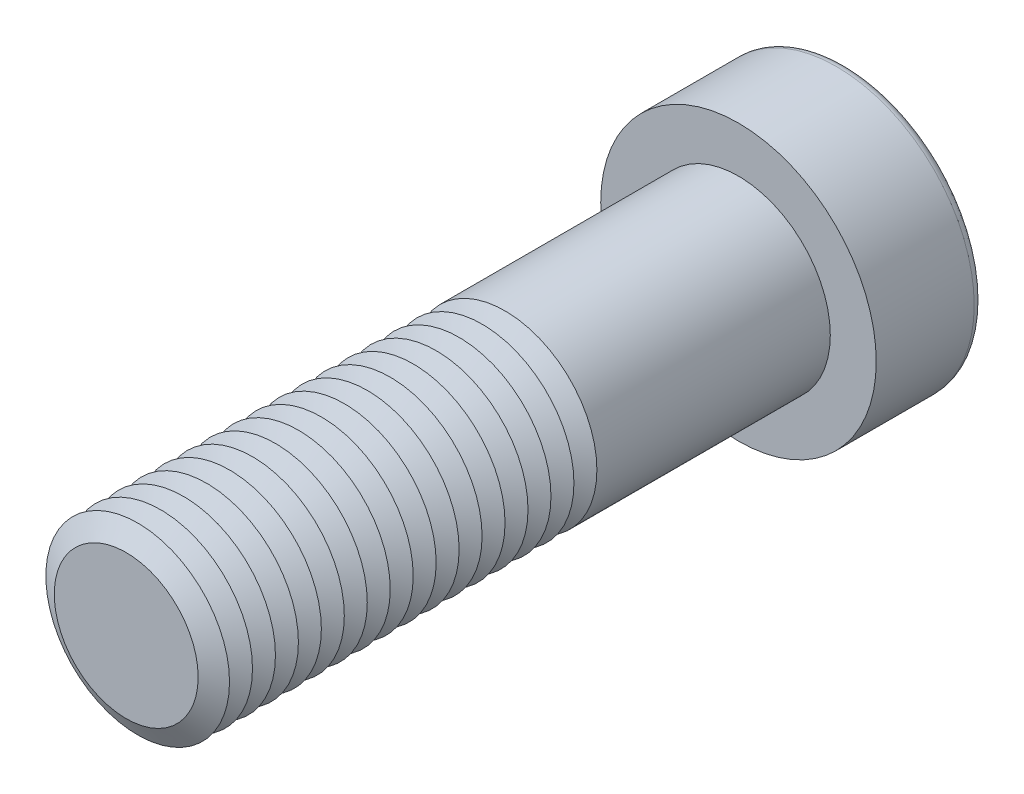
ISO-10303-21;
HEADER;
FILE_DESCRIPTION(('STEP AP214'),'2;1');
FILE_NAME('part.step','',(''),(''),'','','');
FILE_SCHEMA(('AUTOMOTIVE_DESIGN { 1 0 10303 214 1 1 1 1 }'));
ENDSEC;
DATA;
#1=APPLICATION_CONTEXT('core data for automotive mechanical design processes');
#2=APPLICATION_PROTOCOL_DEFINITION('international standard','automotive_design',2000,#1);
#3=PRODUCT_CONTEXT('',#1,'mechanical');
#4=PRODUCT('Part','Part','',(#3));
#5=PRODUCT_RELATED_PRODUCT_CATEGORY('part','',(#4));
#6=PRODUCT_DEFINITION_FORMATION('','',#4);
#7=PRODUCT_DEFINITION_CONTEXT('part definition',#1,'design');
#8=PRODUCT_DEFINITION('design','',#6,#7);
#9=PRODUCT_DEFINITION_SHAPE('','',#8);
#10=(LENGTH_UNIT() NAMED_UNIT(*) SI_UNIT(.MILLI.,.METRE.));
#11=(NAMED_UNIT(*) PLANE_ANGLE_UNIT() SI_UNIT($,.RADIAN.));
#12=(NAMED_UNIT(*) SI_UNIT($,.STERADIAN.) SOLID_ANGLE_UNIT());
#13=UNCERTAINTY_MEASURE_WITH_UNIT(LENGTH_MEASURE(1.E-05),#10,'distance_accuracy_value','');
#14=(GEOMETRIC_REPRESENTATION_CONTEXT(3) GLOBAL_UNCERTAINTY_ASSIGNED_CONTEXT((#13)) GLOBAL_UNIT_ASSIGNED_CONTEXT((#10,
#11,#12)) REPRESENTATION_CONTEXT('',''));
#15=CARTESIAN_POINT('',(0.,0.,0.));
#16=DIRECTION('',(0.,0.,1.));
#17=DIRECTION('',(1.,0.,0.));
#18=AXIS2_PLACEMENT_3D('',#15,#16,#17);
#19=CARTESIAN_POINT('',(0.,0.,69.5));
#20=DIRECTION('',(0.,0.,1.));
#21=DIRECTION('',(1.,0.,0.));
#22=AXIS2_PLACEMENT_3D('',#19,#20,#21);
#23=CONICAL_SURFACE('',#22,12.,1.0471975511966);
#24=CARTESIAN_POINT('',(0.,0.,68.));
#25=DIRECTION('',(0.,0.,1.));
#26=DIRECTION('',(1.,0.,0.));
#27=AXIS2_PLACEMENT_3D('',#24,#25,#26);
#28=CIRCLE('',#27,9.40192378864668);
#29=CARTESIAN_POINT('',(9.40192378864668,0.,68.));
#30=VERTEX_POINT('',#29);
#31=EDGE_CURVE('E312',#30,#30,#28,.T.);
#32=ORIENTED_EDGE('',*,*,#31,.T.);
#33=EDGE_LOOP('',(#32));
#34=FACE_BOUND('',#33,.T.);
#35=CARTESIAN_POINT('',(0.,0.,69.5));
#36=DIRECTION('',(0.,0.,1.));
#37=DIRECTION('',(1.,0.,0.));
#38=AXIS2_PLACEMENT_3D('',#35,#36,#37);
#39=CIRCLE('',#38,12.);
#40=CARTESIAN_POINT('',(12.,0.,69.5));
#41=VERTEX_POINT('',#40);
#42=EDGE_CURVE('E315',#41,#41,#39,.T.);
#43=ORIENTED_EDGE('',*,*,#42,.F.);
#44=EDGE_LOOP('',(#43));
#45=FACE_BOUND('',#44,.T.);
#46=ADVANCED_FACE('F39',(#34,#45),#23,.T.);
#47=CARTESIAN_POINT('',(0.,0.,68.));
#48=DIRECTION('',(0.,0.,-1.));
#49=DIRECTION('',(-1.,0.,0.));
#50=AXIS2_PLACEMENT_3D('',#47,#48,#49);
#51=CONICAL_SURFACE('',#50,9.40192378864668,1.0471975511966);
#52=CARTESIAN_POINT('',(0.,0.,66.5));
#53=DIRECTION('',(0.,0.,1.));
#54=DIRECTION('',(1.,0.,0.));
#55=AXIS2_PLACEMENT_3D('',#52,#53,#54);
#56=CIRCLE('',#55,12.);
#57=CARTESIAN_POINT('',(12.,0.,66.5));
#58=VERTEX_POINT('',#57);
#59=EDGE_CURVE('E323',#58,#58,#56,.T.);
#60=ORIENTED_EDGE('',*,*,#59,.T.);
#61=EDGE_LOOP('',(#60));
#62=FACE_BOUND('',#61,.T.);
#63=ORIENTED_EDGE('',*,*,#31,.F.);
#64=EDGE_LOOP('',(#63));
#65=FACE_BOUND('',#64,.T.);
#66=ADVANCED_FACE('F244',(#62,#65),#51,.T.);
#67=CARTESIAN_POINT('',(0.,0.,80.));
#68=DIRECTION('',(0.,0.,1.));
#69=DIRECTION('',(1.,0.,0.));
#70=AXIS2_PLACEMENT_3D('',#67,#68,#69);
#71=PLANE('',#70);
#72=CARTESIAN_POINT('',(0.,0.,80.));
#73=DIRECTION('',(0.,0.,1.));
#74=DIRECTION('',(1.,0.,0.));
#75=AXIS2_PLACEMENT_3D('',#72,#73,#74);
#76=CIRCLE('',#75,9.40192378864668);
#77=CARTESIAN_POINT('',(9.40192378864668,0.,80.));
#78=VERTEX_POINT('',#77);
#79=EDGE_CURVE('E174',#78,#78,#76,.T.);
#80=ORIENTED_EDGE('',*,*,#79,.T.);
#81=EDGE_LOOP('',(#80));
#82=FACE_BOUND('',#81,.T.);
#83=ADVANCED_FACE('F250',(#82),#71,.T.);
#84=CARTESIAN_POINT('',(0.,0.,80.));
#85=DIRECTION('',(0.,0.,-1.));
#86=DIRECTION('',(-1.,0.,0.));
#87=AXIS2_PLACEMENT_3D('',#84,#85,#86);
#88=CONICAL_SURFACE('',#87,9.40192378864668,1.0471975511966);
#89=CARTESIAN_POINT('',(0.,0.,78.5));
#90=DIRECTION('',(0.,0.,1.));
#91=DIRECTION('',(1.,0.,0.));
#92=AXIS2_PLACEMENT_3D('',#89,#90,#91);
#93=CIRCLE('',#92,12.);
#94=CARTESIAN_POINT('',(12.,0.,78.5));
#95=VERTEX_POINT('',#94);
#96=EDGE_CURVE('E290',#95,#95,#93,.T.);
#97=ORIENTED_EDGE('',*,*,#96,.T.);
#98=EDGE_LOOP('',(#97));
#99=FACE_BOUND('',#98,.T.);
#100=ORIENTED_EDGE('',*,*,#79,.F.);
#101=EDGE_LOOP('',(#100));
#102=FACE_BOUND('',#101,.T.);
#103=ADVANCED_FACE('F198',(#99,#102),#88,.T.);
#104=CARTESIAN_POINT('',(0.,0.,78.5));
#105=DIRECTION('',(0.,0.,1.));
#106=DIRECTION('',(1.,0.,0.));
#107=AXIS2_PLACEMENT_3D('',#104,#105,#106);
#108=CONICAL_SURFACE('',#107,12.,1.0471975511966);
#109=CARTESIAN_POINT('',(0.,0.,77.));
#110=DIRECTION('',(0.,0.,1.));
#111=DIRECTION('',(1.,0.,0.));
#112=AXIS2_PLACEMENT_3D('',#109,#110,#111);
#113=CIRCLE('',#112,9.40192378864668);
#114=CARTESIAN_POINT('',(9.40192378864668,0.,77.));
#115=VERTEX_POINT('',#114);
#116=EDGE_CURVE('E287',#115,#115,#113,.T.);
#117=ORIENTED_EDGE('',*,*,#116,.T.);
#118=EDGE_LOOP('',(#117));
#119=FACE_BOUND('',#118,.T.);
#120=ORIENTED_EDGE('',*,*,#96,.F.);
#121=EDGE_LOOP('',(#120));
#122=FACE_BOUND('',#121,.T.);
#123=ADVANCED_FACE('F276',(#119,#122),#108,.T.);
#124=CARTESIAN_POINT('',(0.,0.,77.));
#125=DIRECTION('',(0.,0.,-1.));
#126=DIRECTION('',(-1.,0.,0.));
#127=AXIS2_PLACEMENT_3D('',#124,#125,#126);
#128=CONICAL_SURFACE('',#127,9.40192378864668,1.0471975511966);
#129=CARTESIAN_POINT('',(0.,0.,75.5));
#130=DIRECTION('',(0.,0.,1.));
#131=DIRECTION('',(1.,0.,0.));
#132=AXIS2_PLACEMENT_3D('',#129,#130,#131);
#133=CIRCLE('',#132,12.);
#134=CARTESIAN_POINT('',(12.,0.,75.5));
#135=VERTEX_POINT('',#134);
#136=EDGE_CURVE('E298',#135,#135,#133,.T.);
#137=ORIENTED_EDGE('',*,*,#136,.T.);
#138=EDGE_LOOP('',(#137));
#139=FACE_BOUND('',#138,.T.);
#140=ORIENTED_EDGE('',*,*,#116,.F.);
#141=EDGE_LOOP('',(#140));
#142=FACE_BOUND('',#141,.T.);
#143=ADVANCED_FACE('F273',(#139,#142),#128,.T.);
#144=CARTESIAN_POINT('',(0.,0.,75.5));
#145=DIRECTION('',(0.,0.,1.));
#146=DIRECTION('',(1.,0.,0.));
#147=AXIS2_PLACEMENT_3D('',#144,#145,#146);
#148=CONICAL_SURFACE('',#147,12.,1.0471975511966);
#149=CARTESIAN_POINT('',(0.,0.,74.));
#150=DIRECTION('',(0.,0.,1.));
#151=DIRECTION('',(1.,0.,0.));
#152=AXIS2_PLACEMENT_3D('',#149,#150,#151);
#153=CIRCLE('',#152,9.40192378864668);
#154=CARTESIAN_POINT('',(9.40192378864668,0.,74.));
#155=VERTEX_POINT('',#154);
#156=EDGE_CURVE('E292',#155,#155,#153,.T.);
#157=ORIENTED_EDGE('',*,*,#156,.T.);
#158=EDGE_LOOP('',(#157));
#159=FACE_BOUND('',#158,.T.);
#160=ORIENTED_EDGE('',*,*,#136,.F.);
#161=EDGE_LOOP('',(#160));
#162=FACE_BOUND('',#161,.T.);
#163=ADVANCED_FACE('F269',(#159,#162),#148,.T.);
#164=CARTESIAN_POINT('',(0.,0.,74.));
#165=DIRECTION('',(0.,0.,-1.));
#166=DIRECTION('',(-1.,0.,0.));
#167=AXIS2_PLACEMENT_3D('',#164,#165,#166);
#168=CONICAL_SURFACE('',#167,9.40192378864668,1.0471975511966);
#169=CARTESIAN_POINT('',(0.,0.,72.5));
#170=DIRECTION('',(0.,0.,1.));
#171=DIRECTION('',(1.,0.,0.));
#172=AXIS2_PLACEMENT_3D('',#169,#170,#171);
#173=CIRCLE('',#172,12.);
#174=CARTESIAN_POINT('',(12.,0.,72.5));
#175=VERTEX_POINT('',#174);
#176=EDGE_CURVE('E308',#175,#175,#173,.T.);
#177=ORIENTED_EDGE('',*,*,#176,.T.);
#178=EDGE_LOOP('',(#177));
#179=FACE_BOUND('',#178,.T.);
#180=ORIENTED_EDGE('',*,*,#156,.F.);
#181=EDGE_LOOP('',(#180));
#182=FACE_BOUND('',#181,.T.);
#183=ADVANCED_FACE('F265',(#179,#182),#168,.T.);
#184=CARTESIAN_POINT('',(0.,0.,72.5));
#185=DIRECTION('',(0.,0.,1.));
#186=DIRECTION('',(1.,0.,0.));
#187=AXIS2_PLACEMENT_3D('',#184,#185,#186);
#188=CONICAL_SURFACE('',#187,12.,1.0471975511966);
#189=CARTESIAN_POINT('',(0.,0.,71.));
#190=DIRECTION('',(0.,0.,1.));
#191=DIRECTION('',(1.,0.,0.));
#192=AXIS2_PLACEMENT_3D('',#189,#190,#191);
#193=CIRCLE('',#192,9.40192378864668);
#194=CARTESIAN_POINT('',(9.40192378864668,0.,71.));
#195=VERTEX_POINT('',#194);
#196=EDGE_CURVE('E304',#195,#195,#193,.T.);
#197=ORIENTED_EDGE('',*,*,#196,.T.);
#198=EDGE_LOOP('',(#197));
#199=FACE_BOUND('',#198,.T.);
#200=ORIENTED_EDGE('',*,*,#176,.F.);
#201=EDGE_LOOP('',(#200));
#202=FACE_BOUND('',#201,.T.);
#203=ADVANCED_FACE('F261',(#199,#202),#188,.T.);
#204=CARTESIAN_POINT('',(0.,0.,71.));
#205=DIRECTION('',(0.,0.,-1.));
#206=DIRECTION('',(-1.,0.,0.));
#207=AXIS2_PLACEMENT_3D('',#204,#205,#206);
#208=CONICAL_SURFACE('',#207,9.40192378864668,1.0471975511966);
#209=ORIENTED_EDGE('',*,*,#42,.T.);
#210=EDGE_LOOP('',(#209));
#211=FACE_BOUND('',#210,.T.);
#212=ORIENTED_EDGE('',*,*,#196,.F.);
#213=EDGE_LOOP('',(#212));
#214=FACE_BOUND('',#213,.T.);
#215=ADVANCED_FACE('F257',(#211,#214),#208,.T.);
#216=CARTESIAN_POINT('',(0.,0.,66.5));
#217=DIRECTION('',(0.,0.,1.));
#218=DIRECTION('',(1.,0.,0.));
#219=AXIS2_PLACEMENT_3D('',#216,#217,#218);
#220=CONICAL_SURFACE('',#219,12.,1.0471975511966);
#221=CARTESIAN_POINT('',(0.,0.,65.));
#222=DIRECTION('',(0.,0.,1.));
#223=DIRECTION('',(1.,0.,0.));
#224=AXIS2_PLACEMENT_3D('',#221,#222,#223);
#225=CIRCLE('',#224,9.40192378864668);
#226=CARTESIAN_POINT('',(9.40192378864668,0.,65.));
#227=VERTEX_POINT('',#226);
#228=EDGE_CURVE('E319',#227,#227,#225,.T.);
#229=ORIENTED_EDGE('',*,*,#228,.T.);
#230=EDGE_LOOP('',(#229));
#231=FACE_BOUND('',#230,.T.);
#232=ORIENTED_EDGE('',*,*,#59,.F.);
#233=EDGE_LOOP('',(#232));
#234=FACE_BOUND('',#233,.T.);
#235=ADVANCED_FACE('F260',(#231,#234),#220,.T.);
#236=CARTESIAN_POINT('',(0.,0.,65.));
#237=DIRECTION('',(0.,0.,-1.));
#238=DIRECTION('',(-1.,0.,0.));
#239=AXIS2_PLACEMENT_3D('',#236,#237,#238);
#240=CONICAL_SURFACE('',#239,9.40192378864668,1.0471975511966);
#241=CARTESIAN_POINT('',(0.,0.,63.5));
#242=DIRECTION('',(0.,0.,1.));
#243=DIRECTION('',(1.,0.,0.));
#244=AXIS2_PLACEMENT_3D('',#241,#242,#243);
#245=CIRCLE('',#244,12.);
#246=CARTESIAN_POINT('',(12.,0.,63.5));
#247=VERTEX_POINT('',#246);
#248=EDGE_CURVE('E330',#247,#247,#245,.T.);
#249=ORIENTED_EDGE('',*,*,#248,.T.);
#250=EDGE_LOOP('',(#249));
#251=FACE_BOUND('',#250,.T.);
#252=ORIENTED_EDGE('',*,*,#228,.F.);
#253=EDGE_LOOP('',(#252));
#254=FACE_BOUND('',#253,.T.);
#255=ADVANCED_FACE('F509',(#251,#254),#240,.T.);
#256=CARTESIAN_POINT('',(0.,0.,63.5));
#257=DIRECTION('',(0.,0.,1.));
#258=DIRECTION('',(1.,0.,0.));
#259=AXIS2_PLACEMENT_3D('',#256,#257,#258);
#260=CONICAL_SURFACE('',#259,12.,1.0471975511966);
#261=CARTESIAN_POINT('',(0.,0.,62.));
#262=DIRECTION('',(0.,0.,1.));
#263=DIRECTION('',(1.,0.,0.));
#264=AXIS2_PLACEMENT_3D('',#261,#262,#263);
#265=CIRCLE('',#264,9.40192378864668);
#266=CARTESIAN_POINT('',(9.40192378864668,0.,62.));
#267=VERTEX_POINT('',#266);
#268=EDGE_CURVE('E327',#267,#267,#265,.T.);
#269=ORIENTED_EDGE('',*,*,#268,.T.);
#270=EDGE_LOOP('',(#269));
#271=FACE_BOUND('',#270,.T.);
#272=ORIENTED_EDGE('',*,*,#248,.F.);
#273=EDGE_LOOP('',(#272));
#274=FACE_BOUND('',#273,.T.);
#275=ADVANCED_FACE('F505',(#271,#274),#260,.T.);
#276=CARTESIAN_POINT('',(0.,0.,62.));
#277=DIRECTION('',(0.,0.,-1.));
#278=DIRECTION('',(-1.,0.,0.));
#279=AXIS2_PLACEMENT_3D('',#276,#277,#278);
#280=CONICAL_SURFACE('',#279,9.40192378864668,1.0471975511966);
#281=CARTESIAN_POINT('',(0.,0.,60.5));
#282=DIRECTION('',(0.,0.,1.));
#283=DIRECTION('',(1.,0.,0.));
#284=AXIS2_PLACEMENT_3D('',#281,#282,#283);
#285=CIRCLE('',#284,12.);
#286=CARTESIAN_POINT('',(12.,0.,60.5));
#287=VERTEX_POINT('',#286);
#288=EDGE_CURVE('E338',#287,#287,#285,.T.);
#289=ORIENTED_EDGE('',*,*,#288,.T.);
#290=EDGE_LOOP('',(#289));
#291=FACE_BOUND('',#290,.T.);
#292=ORIENTED_EDGE('',*,*,#268,.F.);
#293=EDGE_LOOP('',(#292));
#294=FACE_BOUND('',#293,.T.);
#295=ADVANCED_FACE('F501',(#291,#294),#280,.T.);
#296=CARTESIAN_POINT('',(0.,0.,60.5));
#297=DIRECTION('',(0.,0.,1.));
#298=DIRECTION('',(1.,0.,0.));
#299=AXIS2_PLACEMENT_3D('',#296,#297,#298);
#300=CONICAL_SURFACE('',#299,12.,1.0471975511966);
#301=CARTESIAN_POINT('',(0.,0.,59.));
#302=DIRECTION('',(0.,0.,1.));
#303=DIRECTION('',(1.,0.,0.));
#304=AXIS2_PLACEMENT_3D('',#301,#302,#303);
#305=CIRCLE('',#304,9.40192378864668);
#306=CARTESIAN_POINT('',(9.40192378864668,0.,59.));
#307=VERTEX_POINT('',#306);
#308=EDGE_CURVE('E334',#307,#307,#305,.T.);
#309=ORIENTED_EDGE('',*,*,#308,.T.);
#310=EDGE_LOOP('',(#309));
#311=FACE_BOUND('',#310,.T.);
#312=ORIENTED_EDGE('',*,*,#288,.F.);
#313=EDGE_LOOP('',(#312));
#314=FACE_BOUND('',#313,.T.);
#315=ADVANCED_FACE('F497',(#311,#314),#300,.T.);
#316=CARTESIAN_POINT('',(0.,0.,59.));
#317=DIRECTION('',(0.,0.,-1.));
#318=DIRECTION('',(-1.,0.,0.));
#319=AXIS2_PLACEMENT_3D('',#316,#317,#318);
#320=CONICAL_SURFACE('',#319,9.40192378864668,1.0471975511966);
#321=CARTESIAN_POINT('',(0.,0.,57.5));
#322=DIRECTION('',(0.,0.,1.));
#323=DIRECTION('',(1.,0.,0.));
#324=AXIS2_PLACEMENT_3D('',#321,#322,#323);
#325=CIRCLE('',#324,12.);
#326=CARTESIAN_POINT('',(12.,0.,57.5));
#327=VERTEX_POINT('',#326);
#328=EDGE_CURVE('E346',#327,#327,#325,.T.);
#329=ORIENTED_EDGE('',*,*,#328,.T.);
#330=EDGE_LOOP('',(#329));
#331=FACE_BOUND('',#330,.T.);
#332=ORIENTED_EDGE('',*,*,#308,.F.);
#333=EDGE_LOOP('',(#332));
#334=FACE_BOUND('',#333,.T.);
#335=ADVANCED_FACE('F493',(#331,#334),#320,.T.);
#336=CARTESIAN_POINT('',(0.,0.,57.5));
#337=DIRECTION('',(0.,0.,1.));
#338=DIRECTION('',(1.,0.,0.));
#339=AXIS2_PLACEMENT_3D('',#336,#337,#338);
#340=CONICAL_SURFACE('',#339,12.,1.0471975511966);
#341=CARTESIAN_POINT('',(0.,0.,56.));
#342=DIRECTION('',(0.,0.,1.));
#343=DIRECTION('',(1.,0.,0.));
#344=AXIS2_PLACEMENT_3D('',#341,#342,#343);
#345=CIRCLE('',#344,9.40192378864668);
#346=CARTESIAN_POINT('',(9.40192378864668,0.,56.));
#347=VERTEX_POINT('',#346);
#348=EDGE_CURVE('E342',#347,#347,#345,.T.);
#349=ORIENTED_EDGE('',*,*,#348,.T.);
#350=EDGE_LOOP('',(#349));
#351=FACE_BOUND('',#350,.T.);
#352=ORIENTED_EDGE('',*,*,#328,.F.);
#353=EDGE_LOOP('',(#352));
#354=FACE_BOUND('',#353,.T.);
#355=ADVANCED_FACE('F489',(#351,#354),#340,.T.);
#356=CARTESIAN_POINT('',(0.,0.,56.));
#357=DIRECTION('',(0.,0.,-1.));
#358=DIRECTION('',(-1.,0.,0.));
#359=AXIS2_PLACEMENT_3D('',#356,#357,#358);
#360=CONICAL_SURFACE('',#359,9.40192378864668,1.0471975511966);
#361=CARTESIAN_POINT('',(0.,0.,54.5));
#362=DIRECTION('',(0.,0.,1.));
#363=DIRECTION('',(1.,0.,0.));
#364=AXIS2_PLACEMENT_3D('',#361,#362,#363);
#365=CIRCLE('',#364,12.);
#366=CARTESIAN_POINT('',(12.,0.,54.5));
#367=VERTEX_POINT('',#366);
#368=EDGE_CURVE('E354',#367,#367,#365,.T.);
#369=ORIENTED_EDGE('',*,*,#368,.T.);
#370=EDGE_LOOP('',(#369));
#371=FACE_BOUND('',#370,.T.);
#372=ORIENTED_EDGE('',*,*,#348,.F.);
#373=EDGE_LOOP('',(#372));
#374=FACE_BOUND('',#373,.T.);
#375=ADVANCED_FACE('F485',(#371,#374),#360,.T.);
#376=CARTESIAN_POINT('',(0.,0.,54.5));
#377=DIRECTION('',(0.,0.,1.));
#378=DIRECTION('',(1.,0.,0.));
#379=AXIS2_PLACEMENT_3D('',#376,#377,#378);
#380=CONICAL_SURFACE('',#379,12.,1.0471975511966);
#381=CARTESIAN_POINT('',(0.,0.,53.));
#382=DIRECTION('',(0.,0.,1.));
#383=DIRECTION('',(1.,0.,0.));
#384=AXIS2_PLACEMENT_3D('',#381,#382,#383);
#385=CIRCLE('',#384,9.40192378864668);
#386=CARTESIAN_POINT('',(9.40192378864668,0.,53.));
#387=VERTEX_POINT('',#386);
#388=EDGE_CURVE('E350',#387,#387,#385,.T.);
#389=ORIENTED_EDGE('',*,*,#388,.T.);
#390=EDGE_LOOP('',(#389));
#391=FACE_BOUND('',#390,.T.);
#392=ORIENTED_EDGE('',*,*,#368,.F.);
#393=EDGE_LOOP('',(#392));
#394=FACE_BOUND('',#393,.T.);
#395=ADVANCED_FACE('F481',(#391,#394),#380,.T.);
#396=CARTESIAN_POINT('',(0.,0.,53.));
#397=DIRECTION('',(0.,0.,-1.));
#398=DIRECTION('',(-1.,0.,0.));
#399=AXIS2_PLACEMENT_3D('',#396,#397,#398);
#400=CONICAL_SURFACE('',#399,9.40192378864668,1.0471975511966);
#401=CARTESIAN_POINT('',(0.,0.,51.5));
#402=DIRECTION('',(0.,0.,1.));
#403=DIRECTION('',(1.,0.,0.));
#404=AXIS2_PLACEMENT_3D('',#401,#402,#403);
#405=CIRCLE('',#404,12.);
#406=CARTESIAN_POINT('',(12.,0.,51.5));
#407=VERTEX_POINT('',#406);
#408=EDGE_CURVE('E362',#407,#407,#405,.T.);
#409=ORIENTED_EDGE('',*,*,#408,.T.);
#410=EDGE_LOOP('',(#409));
#411=FACE_BOUND('',#410,.T.);
#412=ORIENTED_EDGE('',*,*,#388,.F.);
#413=EDGE_LOOP('',(#412));
#414=FACE_BOUND('',#413,.T.);
#415=ADVANCED_FACE('F477',(#411,#414),#400,.T.);
#416=CARTESIAN_POINT('',(0.,0.,51.5));
#417=DIRECTION('',(0.,0.,1.));
#418=DIRECTION('',(1.,0.,0.));
#419=AXIS2_PLACEMENT_3D('',#416,#417,#418);
#420=CONICAL_SURFACE('',#419,12.,1.0471975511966);
#421=CARTESIAN_POINT('',(0.,0.,50.));
#422=DIRECTION('',(0.,0.,1.));
#423=DIRECTION('',(1.,0.,0.));
#424=AXIS2_PLACEMENT_3D('',#421,#422,#423);
#425=CIRCLE('',#424,9.40192378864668);
#426=CARTESIAN_POINT('',(9.40192378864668,0.,50.));
#427=VERTEX_POINT('',#426);
#428=EDGE_CURVE('E358',#427,#427,#425,.T.);
#429=ORIENTED_EDGE('',*,*,#428,.T.);
#430=EDGE_LOOP('',(#429));
#431=FACE_BOUND('',#430,.T.);
#432=ORIENTED_EDGE('',*,*,#408,.F.);
#433=EDGE_LOOP('',(#432));
#434=FACE_BOUND('',#433,.T.);
#435=ADVANCED_FACE('F473',(#431,#434),#420,.T.);
#436=CARTESIAN_POINT('',(0.,0.,50.));
#437=DIRECTION('',(0.,0.,-1.));
#438=DIRECTION('',(-1.,0.,0.));
#439=AXIS2_PLACEMENT_3D('',#436,#437,#438);
#440=CONICAL_SURFACE('',#439,9.40192378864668,1.0471975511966);
#441=CARTESIAN_POINT('',(0.,0.,48.5));
#442=DIRECTION('',(0.,0.,1.));
#443=DIRECTION('',(1.,0.,0.));
#444=AXIS2_PLACEMENT_3D('',#441,#442,#443);
#445=CIRCLE('',#444,12.);
#446=CARTESIAN_POINT('',(12.,0.,48.5));
#447=VERTEX_POINT('',#446);
#448=EDGE_CURVE('E370',#447,#447,#445,.T.);
#449=ORIENTED_EDGE('',*,*,#448,.T.);
#450=EDGE_LOOP('',(#449));
#451=FACE_BOUND('',#450,.T.);
#452=ORIENTED_EDGE('',*,*,#428,.F.);
#453=EDGE_LOOP('',(#452));
#454=FACE_BOUND('',#453,.T.);
#455=ADVANCED_FACE('F469',(#451,#454),#440,.T.);
#456=CARTESIAN_POINT('',(0.,0.,48.5));
#457=DIRECTION('',(0.,0.,1.));
#458=DIRECTION('',(1.,0.,0.));
#459=AXIS2_PLACEMENT_3D('',#456,#457,#458);
#460=CONICAL_SURFACE('',#459,12.,1.0471975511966);
#461=CARTESIAN_POINT('',(0.,0.,47.));
#462=DIRECTION('',(0.,0.,1.));
#463=DIRECTION('',(1.,0.,0.));
#464=AXIS2_PLACEMENT_3D('',#461,#462,#463);
#465=CIRCLE('',#464,9.40192378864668);
#466=CARTESIAN_POINT('',(9.40192378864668,0.,47.));
#467=VERTEX_POINT('',#466);
#468=EDGE_CURVE('E366',#467,#467,#465,.T.);
#469=ORIENTED_EDGE('',*,*,#468,.T.);
#470=EDGE_LOOP('',(#469));
#471=FACE_BOUND('',#470,.T.);
#472=ORIENTED_EDGE('',*,*,#448,.F.);
#473=EDGE_LOOP('',(#472));
#474=FACE_BOUND('',#473,.T.);
#475=ADVANCED_FACE('F465',(#471,#474),#460,.T.);
#476=CARTESIAN_POINT('',(0.,0.,47.));
#477=DIRECTION('',(0.,0.,-1.));
#478=DIRECTION('',(-1.,0.,0.));
#479=AXIS2_PLACEMENT_3D('',#476,#477,#478);
#480=CONICAL_SURFACE('',#479,9.40192378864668,1.0471975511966);
#481=CARTESIAN_POINT('',(0.,0.,45.5));
#482=DIRECTION('',(0.,0.,1.));
#483=DIRECTION('',(1.,0.,0.));
#484=AXIS2_PLACEMENT_3D('',#481,#482,#483);
#485=CIRCLE('',#484,12.);
#486=CARTESIAN_POINT('',(12.,0.,45.5));
#487=VERTEX_POINT('',#486);
#488=EDGE_CURVE('E378',#487,#487,#485,.T.);
#489=ORIENTED_EDGE('',*,*,#488,.T.);
#490=EDGE_LOOP('',(#489));
#491=FACE_BOUND('',#490,.T.);
#492=ORIENTED_EDGE('',*,*,#468,.F.);
#493=EDGE_LOOP('',(#492));
#494=FACE_BOUND('',#493,.T.);
#495=ADVANCED_FACE('F461',(#491,#494),#480,.T.);
#496=CARTESIAN_POINT('',(0.,0.,45.5));
#497=DIRECTION('',(0.,0.,1.));
#498=DIRECTION('',(1.,0.,0.));
#499=AXIS2_PLACEMENT_3D('',#496,#497,#498);
#500=CONICAL_SURFACE('',#499,12.,1.0471975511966);
#501=CARTESIAN_POINT('',(0.,0.,44.));
#502=DIRECTION('',(0.,0.,1.));
#503=DIRECTION('',(1.,0.,0.));
#504=AXIS2_PLACEMENT_3D('',#501,#502,#503);
#505=CIRCLE('',#504,9.40192378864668);
#506=CARTESIAN_POINT('',(9.40192378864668,0.,44.));
#507=VERTEX_POINT('',#506);
#508=EDGE_CURVE('E374',#507,#507,#505,.T.);
#509=ORIENTED_EDGE('',*,*,#508,.T.);
#510=EDGE_LOOP('',(#509));
#511=FACE_BOUND('',#510,.T.);
#512=ORIENTED_EDGE('',*,*,#488,.F.);
#513=EDGE_LOOP('',(#512));
#514=FACE_BOUND('',#513,.T.);
#515=ADVANCED_FACE('F457',(#511,#514),#500,.T.);
#516=CARTESIAN_POINT('',(0.,0.,44.));
#517=DIRECTION('',(0.,0.,-1.));
#518=DIRECTION('',(-1.,0.,0.));
#519=AXIS2_PLACEMENT_3D('',#516,#517,#518);
#520=CONICAL_SURFACE('',#519,9.40192378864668,1.0471975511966);
#521=CARTESIAN_POINT('',(0.,0.,42.5));
#522=DIRECTION('',(0.,0.,1.));
#523=DIRECTION('',(1.,0.,0.));
#524=AXIS2_PLACEMENT_3D('',#521,#522,#523);
#525=CIRCLE('',#524,12.);
#526=CARTESIAN_POINT('',(12.,0.,42.5));
#527=VERTEX_POINT('',#526);
#528=EDGE_CURVE('E385',#527,#527,#525,.T.);
#529=ORIENTED_EDGE('',*,*,#528,.T.);
#530=EDGE_LOOP('',(#529));
#531=FACE_BOUND('',#530,.T.);
#532=ORIENTED_EDGE('',*,*,#508,.F.);
#533=EDGE_LOOP('',(#532));
#534=FACE_BOUND('',#533,.T.);
#535=ADVANCED_FACE('F453',(#531,#534),#520,.T.);
#536=CARTESIAN_POINT('',(0.,0.,42.5));
#537=DIRECTION('',(0.,0.,1.));
#538=DIRECTION('',(1.,0.,0.));
#539=AXIS2_PLACEMENT_3D('',#536,#537,#538);
#540=CONICAL_SURFACE('',#539,12.,1.0471975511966);
#541=CARTESIAN_POINT('',(0.,0.,41.));
#542=DIRECTION('',(0.,0.,1.));
#543=DIRECTION('',(1.,0.,0.));
#544=AXIS2_PLACEMENT_3D('',#541,#542,#543);
#545=CIRCLE('',#544,9.40192378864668);
#546=CARTESIAN_POINT('',(9.40192378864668,0.,41.));
#547=VERTEX_POINT('',#546);
#548=EDGE_CURVE('E382',#547,#547,#545,.T.);
#549=ORIENTED_EDGE('',*,*,#548,.T.);
#550=EDGE_LOOP('',(#549));
#551=FACE_BOUND('',#550,.T.);
#552=ORIENTED_EDGE('',*,*,#528,.F.);
#553=EDGE_LOOP('',(#552));
#554=FACE_BOUND('',#553,.T.);
#555=ADVANCED_FACE('F449',(#551,#554),#540,.T.);
#556=CARTESIAN_POINT('',(0.,0.,41.));
#557=DIRECTION('',(0.,0.,-1.));
#558=DIRECTION('',(-1.,0.,0.));
#559=AXIS2_PLACEMENT_3D('',#556,#557,#558);
#560=CONICAL_SURFACE('',#559,9.40192378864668,1.0471975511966);
#561=CARTESIAN_POINT('',(0.,0.,39.5));
#562=DIRECTION('',(0.,0.,1.));
#563=DIRECTION('',(1.,0.,0.));
#564=AXIS2_PLACEMENT_3D('',#561,#562,#563);
#565=CIRCLE('',#564,12.);
#566=CARTESIAN_POINT('',(12.,0.,39.5));
#567=VERTEX_POINT('',#566);
#568=EDGE_CURVE('E393',#567,#567,#565,.T.);
#569=ORIENTED_EDGE('',*,*,#568,.T.);
#570=EDGE_LOOP('',(#569));
#571=FACE_BOUND('',#570,.T.);
#572=ORIENTED_EDGE('',*,*,#548,.F.);
#573=EDGE_LOOP('',(#572));
#574=FACE_BOUND('',#573,.T.);
#575=ADVANCED_FACE('F445',(#571,#574),#560,.T.);
#576=CARTESIAN_POINT('',(0.,0.,39.5));
#577=DIRECTION('',(0.,0.,1.));
#578=DIRECTION('',(1.,0.,0.));
#579=AXIS2_PLACEMENT_3D('',#576,#577,#578);
#580=CONICAL_SURFACE('',#579,12.,1.0471975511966);
#581=CARTESIAN_POINT('',(0.,0.,38.));
#582=DIRECTION('',(0.,0.,1.));
#583=DIRECTION('',(1.,0.,0.));
#584=AXIS2_PLACEMENT_3D('',#581,#582,#583);
#585=CIRCLE('',#584,9.40192378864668);
#586=CARTESIAN_POINT('',(9.40192378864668,0.,38.));
#587=VERTEX_POINT('',#586);
#588=EDGE_CURVE('E389',#587,#587,#585,.T.);
#589=ORIENTED_EDGE('',*,*,#588,.T.);
#590=EDGE_LOOP('',(#589));
#591=FACE_BOUND('',#590,.T.);
#592=ORIENTED_EDGE('',*,*,#568,.F.);
#593=EDGE_LOOP('',(#592));
#594=FACE_BOUND('',#593,.T.);
#595=ADVANCED_FACE('F441',(#591,#594),#580,.T.);
#596=CARTESIAN_POINT('',(0.,0.,38.));
#597=DIRECTION('',(0.,0.,-1.));
#598=DIRECTION('',(-1.,0.,0.));
#599=AXIS2_PLACEMENT_3D('',#596,#597,#598);
#600=CONICAL_SURFACE('',#599,9.40192378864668,1.0471975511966);
#601=CARTESIAN_POINT('',(0.,0.,36.5));
#602=DIRECTION('',(0.,0.,1.));
#603=DIRECTION('',(1.,0.,0.));
#604=AXIS2_PLACEMENT_3D('',#601,#602,#603);
#605=CIRCLE('',#604,12.);
#606=CARTESIAN_POINT('',(12.,0.,36.5));
#607=VERTEX_POINT('',#606);
#608=EDGE_CURVE('E401',#607,#607,#605,.T.);
#609=ORIENTED_EDGE('',*,*,#608,.T.);
#610=EDGE_LOOP('',(#609));
#611=FACE_BOUND('',#610,.T.);
#612=ORIENTED_EDGE('',*,*,#588,.F.);
#613=EDGE_LOOP('',(#612));
#614=FACE_BOUND('',#613,.T.);
#615=ADVANCED_FACE('F437',(#611,#614),#600,.T.);
#616=CARTESIAN_POINT('',(0.,0.,36.5));
#617=DIRECTION('',(0.,0.,1.));
#618=DIRECTION('',(1.,0.,0.));
#619=AXIS2_PLACEMENT_3D('',#616,#617,#618);
#620=CONICAL_SURFACE('',#619,12.,1.0471975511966);
#621=CARTESIAN_POINT('',(0.,0.,35.));
#622=DIRECTION('',(0.,0.,1.));
#623=DIRECTION('',(1.,0.,0.));
#624=AXIS2_PLACEMENT_3D('',#621,#622,#623);
#625=CIRCLE('',#624,9.40192378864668);
#626=CARTESIAN_POINT('',(9.40192378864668,0.,35.));
#627=VERTEX_POINT('',#626);
#628=EDGE_CURVE('E397',#627,#627,#625,.T.);
#629=ORIENTED_EDGE('',*,*,#628,.T.);
#630=EDGE_LOOP('',(#629));
#631=FACE_BOUND('',#630,.T.);
#632=ORIENTED_EDGE('',*,*,#608,.F.);
#633=EDGE_LOOP('',(#632));
#634=FACE_BOUND('',#633,.T.);
#635=ADVANCED_FACE('F432',(#631,#634),#620,.T.);
#636=CARTESIAN_POINT('',(0.,0.,35.));
#637=DIRECTION('',(0.,0.,-1.));
#638=DIRECTION('',(-1.,0.,0.));
#639=AXIS2_PLACEMENT_3D('',#636,#637,#638);
#640=CONICAL_SURFACE('',#639,9.40192378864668,1.0471975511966);
#641=CARTESIAN_POINT('',(0.,0.,33.5));
#642=DIRECTION('',(0.,0.,1.));
#643=DIRECTION('',(1.,0.,0.));
#644=AXIS2_PLACEMENT_3D('',#641,#642,#643);
#645=CIRCLE('',#644,12.);
#646=CARTESIAN_POINT('',(12.,0.,33.5));
#647=VERTEX_POINT('',#646);
#648=EDGE_CURVE('E413',#647,#647,#645,.T.);
#649=ORIENTED_EDGE('',*,*,#648,.T.);
#650=EDGE_LOOP('',(#649));
#651=FACE_BOUND('',#650,.T.);
#652=ORIENTED_EDGE('',*,*,#628,.F.);
#653=EDGE_LOOP('',(#652));
#654=FACE_BOUND('',#653,.T.);
#655=ADVANCED_FACE('F418',(#651,#654),#640,.T.);
#656=CARTESIAN_POINT('',(0.,0.,33.5));
#657=DIRECTION('',(0.,0.,1.));
#658=DIRECTION('',(1.,0.,0.));
#659=AXIS2_PLACEMENT_3D('',#656,#657,#658);
#660=CONICAL_SURFACE('',#659,12.,1.0471975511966);
#661=CARTESIAN_POINT('',(0.,0.,32.));
#662=DIRECTION('',(0.,0.,1.));
#663=DIRECTION('',(1.,0.,0.));
#664=AXIS2_PLACEMENT_3D('',#661,#662,#663);
#665=CIRCLE('',#664,9.40192378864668);
#666=CARTESIAN_POINT('',(9.40192378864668,0.,32.));
#667=VERTEX_POINT('',#666);
#668=EDGE_CURVE('E405',#667,#667,#665,.T.);
#669=ORIENTED_EDGE('',*,*,#668,.T.);
#670=EDGE_LOOP('',(#669));
#671=FACE_BOUND('',#670,.T.);
#672=ORIENTED_EDGE('',*,*,#648,.F.);
#673=EDGE_LOOP('',(#672));
#674=FACE_BOUND('',#673,.T.);
#675=ADVANCED_FACE('F421',(#671,#674),#660,.T.);
#676=CARTESIAN_POINT('',(0.,0.,32.));
#677=DIRECTION('',(0.,0.,-1.));
#678=DIRECTION('',(-1.,0.,0.));
#679=AXIS2_PLACEMENT_3D('',#676,#677,#678);
#680=CONICAL_SURFACE('',#679,9.40192378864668,1.0471975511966);
#681=CARTESIAN_POINT('',(0.,0.,30.5));
#682=DIRECTION('',(0.,0.,1.));
#683=DIRECTION('',(1.,0.,0.));
#684=AXIS2_PLACEMENT_3D('',#681,#682,#683);
#685=CIRCLE('',#684,12.);
#686=CARTESIAN_POINT('',(12.,0.,30.5));
#687=VERTEX_POINT('',#686);
#688=EDGE_CURVE('E409',#687,#687,#685,.T.);
#689=ORIENTED_EDGE('',*,*,#688,.T.);
#690=EDGE_LOOP('',(#689));
#691=FACE_BOUND('',#690,.T.);
#692=ORIENTED_EDGE('',*,*,#668,.F.);
#693=EDGE_LOOP('',(#692));
#694=FACE_BOUND('',#693,.T.);
#695=ADVANCED_FACE('F423',(#691,#694),#680,.T.);
#696=CARTESIAN_POINT('',(0.,0.,0.25));
#697=DIRECTION('',(0.,0.,-1.));
#698=DIRECTION('',(-1.,0.,0.));
#699=AXIS2_PLACEMENT_3D('',#696,#697,#698);
#700=CONICAL_SURFACE('',#699,9.5,1.0471975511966);
#701=CARTESIAN_POINT('',(0.,0.,5.73482755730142));
#702=VERTEX_POINT('',#701);
#703=VERTEX_LOOP('',#702);
#704=FACE_BOUND('',#703,.T.);
#705=CARTESIAN_POINT('',(0.,0.,0.25));
#706=DIRECTION('',(0.,0.,-1.));
#707=DIRECTION('',(-1.,0.,0.));
#708=AXIS2_PLACEMENT_3D('',#705,#706,#707);
#709=CIRCLE('',#708,9.5);
#710=CARTESIAN_POINT('',(-8.22724133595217,4.75,0.25));
#711=VERTEX_POINT('',#710);
#712=CARTESIAN_POINT('',(0.,9.5,0.25));
#713=VERTEX_POINT('',#712);
#714=EDGE_CURVE('E149',#711,#713,#709,.T.);
#715=ORIENTED_EDGE('',*,*,#714,.T.);
#716=CARTESIAN_POINT('',(0.,0.,0.25));
#717=DIRECTION('',(0.,0.,-1.));
#718=DIRECTION('',(-1.,0.,0.));
#719=AXIS2_PLACEMENT_3D('',#716,#717,#718);
#720=CIRCLE('',#719,9.5);
#721=CARTESIAN_POINT('',(8.22724133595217,4.75,0.25));
#722=VERTEX_POINT('',#721);
#723=EDGE_CURVE('E54',#713,#722,#720,.T.);
#724=ORIENTED_EDGE('',*,*,#723,.T.);
#725=CARTESIAN_POINT('',(8.22724133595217,-4.75,0.25));
#726=VERTEX_POINT('',#725);
#727=EDGE_CURVE('E1024',#722,#726,#720,.T.);
#728=ORIENTED_EDGE('',*,*,#727,.T.);
#729=CARTESIAN_POINT('',(0.,-9.5,0.25));
#730=VERTEX_POINT('',#729);
#731=EDGE_CURVE('E1023',#726,#730,#720,.T.);
#732=ORIENTED_EDGE('',*,*,#731,.T.);
#733=CARTESIAN_POINT('',(-8.22724133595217,-4.75,0.25));
#734=VERTEX_POINT('',#733);
#735=EDGE_CURVE('E1018',#730,#734,#720,.T.);
#736=ORIENTED_EDGE('',*,*,#735,.T.);
#737=EDGE_CURVE('E1016',#734,#711,#720,.T.);
#738=ORIENTED_EDGE('',*,*,#737,.T.);
#739=EDGE_LOOP('',(#715,#724,#728,#732,#736,#738));
#740=FACE_BOUND('',#739,.T.);
#741=ADVANCED_FACE('F200',(#704,#740),#700,.F.);
#742=CARTESIAN_POINT('',(0.,0.,0.25));
#743=DIRECTION('',(0.,0.,-1.));
#744=DIRECTION('',(-1.,0.,0.));
#745=AXIS2_PLACEMENT_3D('',#742,#743,#744);
#746=PLANE('',#745);
#747=ORIENTED_EDGE('',*,*,#723,.F.);
#748=DIRECTION('',(1.,0.,0.));
#749=VECTOR('',#748,1.);
#750=CARTESIAN_POINT('',(-5.48482755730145,9.5,0.25));
#751=LINE('',#750,#749);
#752=CARTESIAN_POINT('',(5.48482755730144,9.5,0.25));
#753=VERTEX_POINT('',#752);
#754=EDGE_CURVE('E1066',#713,#753,#751,.T.);
#755=ORIENTED_EDGE('',*,*,#754,.T.);
#756=DIRECTION('',(0.5,-0.866025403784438,0.));
#757=VECTOR('',#756,1.);
#758=CARTESIAN_POINT('',(5.48482755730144,9.5,0.25));
#759=LINE('',#758,#757);
#760=EDGE_CURVE('E155',#753,#722,#759,.T.);
#761=ORIENTED_EDGE('',*,*,#760,.T.);
#762=EDGE_LOOP('',(#747,#755,#761));
#763=FACE_BOUND('',#762,.T.);
#764=ADVANCED_FACE('F604',(#763),#746,.T.);
#765=ORIENTED_EDGE('',*,*,#727,.F.);
#766=CARTESIAN_POINT('',(10.9696551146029,0.,0.25));
#767=VERTEX_POINT('',#766);
#768=EDGE_CURVE('E1065',#722,#767,#759,.T.);
#769=ORIENTED_EDGE('',*,*,#768,.T.);
#770=DIRECTION('',(-0.5,-0.866025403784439,0.));
#771=VECTOR('',#770,1.);
#772=CARTESIAN_POINT('',(10.9696551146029,0.,0.25));
#773=LINE('',#772,#771);
#774=EDGE_CURVE('E1038',#767,#726,#773,.T.);
#775=ORIENTED_EDGE('',*,*,#774,.T.);
#776=EDGE_LOOP('',(#765,#769,#775));
#777=FACE_BOUND('',#776,.T.);
#778=ADVANCED_FACE('F614',(#777),#746,.T.);
#779=ORIENTED_EDGE('',*,*,#731,.F.);
#780=CARTESIAN_POINT('',(5.48482755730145,-9.5,0.25));
#781=VERTEX_POINT('',#780);
#782=EDGE_CURVE('E1040',#726,#781,#773,.T.);
#783=ORIENTED_EDGE('',*,*,#782,.T.);
#784=DIRECTION('',(-1.,0.,0.));
#785=VECTOR('',#784,1.);
#786=CARTESIAN_POINT('',(5.48482755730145,-9.5,0.25));
#787=LINE('',#786,#785);
#788=EDGE_CURVE('E991',#781,#730,#787,.T.);
#789=ORIENTED_EDGE('',*,*,#788,.T.);
#790=EDGE_LOOP('',(#779,#783,#789));
#791=FACE_BOUND('',#790,.T.);
#792=ADVANCED_FACE('F624',(#791),#746,.T.);
#793=ORIENTED_EDGE('',*,*,#735,.F.);
#794=CARTESIAN_POINT('',(-5.48482755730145,-9.5,0.25));
#795=VERTEX_POINT('',#794);
#796=EDGE_CURVE('E1034',#730,#795,#787,.T.);
#797=ORIENTED_EDGE('',*,*,#796,.T.);
#798=DIRECTION('',(-0.5,0.866025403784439,0.));
#799=VECTOR('',#798,1.);
#800=CARTESIAN_POINT('',(-5.48482755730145,-9.5,0.25));
#801=LINE('',#800,#799);
#802=EDGE_CURVE('E1036',#795,#734,#801,.T.);
#803=ORIENTED_EDGE('',*,*,#802,.T.);
#804=EDGE_LOOP('',(#793,#797,#803));
#805=FACE_BOUND('',#804,.T.);
#806=ADVANCED_FACE('F632',(#805),#746,.T.);
#807=ORIENTED_EDGE('',*,*,#737,.F.);
#808=CARTESIAN_POINT('',(-10.9696551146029,0.,0.25));
#809=VERTEX_POINT('',#808);
#810=EDGE_CURVE('E1042',#734,#809,#801,.T.);
#811=ORIENTED_EDGE('',*,*,#810,.T.);
#812=DIRECTION('',(0.5,0.866025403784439,0.));
#813=VECTOR('',#812,1.);
#814=CARTESIAN_POINT('',(-10.9696551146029,0.,0.25));
#815=LINE('',#814,#813);
#816=EDGE_CURVE('E158',#809,#711,#815,.T.);
#817=ORIENTED_EDGE('',*,*,#816,.T.);
#818=EDGE_LOOP('',(#807,#811,#817));
#819=FACE_BOUND('',#818,.T.);
#820=ADVANCED_FACE('F230',(#819),#746,.T.);
#821=ORIENTED_EDGE('',*,*,#714,.F.);
#822=CARTESIAN_POINT('',(-5.48482755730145,9.5,0.25));
#823=VERTEX_POINT('',#822);
#824=EDGE_CURVE('E1049',#711,#823,#815,.T.);
#825=ORIENTED_EDGE('',*,*,#824,.T.);
#826=EDGE_CURVE('E1064',#823,#713,#751,.T.);
#827=ORIENTED_EDGE('',*,*,#826,.T.);
#828=EDGE_LOOP('',(#821,#825,#827));
#829=FACE_BOUND('',#828,.T.);
#830=ADVANCED_FACE('F616',(#829),#746,.T.);
#831=CARTESIAN_POINT('',(-5.48482755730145,9.5,0.25));
#832=DIRECTION('',(0.,1.,0.));
#833=DIRECTION('',(0.,0.,1.));
#834=AXIS2_PLACEMENT_3D('',#831,#832,#833);
#835=PLANE('',#834);
#836=DIRECTION('',(0.,0.,-1.));
#837=VECTOR('',#836,1.);
#838=CARTESIAN_POINT('',(-5.48482755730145,9.5,0.25));
#839=LINE('',#838,#837);
#840=CARTESIAN_POINT('',(-5.48482755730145,9.5,-14.));
#841=VERTEX_POINT('',#840);
#842=EDGE_CURVE('E147',#823,#841,#839,.T.);
#843=ORIENTED_EDGE('',*,*,#842,.T.);
#844=CARTESIAN_POINT('',(-14.3184360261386,9.5,-15.6649552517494));
#845=CARTESIAN_POINT('',(-13.8894653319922,9.5,-15.5692031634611));
#846=CARTESIAN_POINT('',(-13.460220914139,9.5,-15.4746548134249));
#847=CARTESIAN_POINT('',(-12.6010505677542,9.5,-15.2886152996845));
#848=CARTESIAN_POINT('',(-12.1711246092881,9.5,-15.1971242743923));
#849=CARTESIAN_POINT('',(-11.3100507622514,9.5,-15.0177651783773));
#850=CARTESIAN_POINT('',(-10.8789020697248,9.5,-14.9299009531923));
#851=CARTESIAN_POINT('',(-10.0156929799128,9.5,-14.7587741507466));
#852=CARTESIAN_POINT('',(-9.5836325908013,9.5,-14.67551153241));
#853=CARTESIAN_POINT('',(-8.72220045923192,9.5,-14.5153788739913));
#854=CARTESIAN_POINT('',(-8.29283790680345,9.5,-14.4384596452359));
#855=CARTESIAN_POINT('',(-7.43292010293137,9.5,-14.2915458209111));
#856=CARTESIAN_POINT('',(-7.0023648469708,9.5,-14.2215512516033));
#857=CARTESIAN_POINT('',(-6.14001360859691,9.5,-14.0901048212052));
#858=CARTESIAN_POINT('',(-5.70821784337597,9.5,-14.0286515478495));
#859=CARTESIAN_POINT('',(-4.84325961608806,9.5,-13.9161318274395));
#860=CARTESIAN_POINT('',(-4.41009715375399,9.5,-13.8650653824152));
#861=CARTESIAN_POINT('',(-3.53757113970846,9.5,-13.7748018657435));
#862=CARTESIAN_POINT('',(-3.09819281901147,9.5,-13.7357454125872));
#863=CARTESIAN_POINT('',(-2.2183738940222,9.5,-13.6722240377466));
#864=CARTESIAN_POINT('',(-1.77793331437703,9.5,-13.6477587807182));
#865=CARTESIAN_POINT('',(-0.896631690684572,9.5,-13.6148480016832));
#866=CARTESIAN_POINT('',(-0.455770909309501,9.5,-13.606395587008));
#867=CARTESIAN_POINT('',(0.425958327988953,9.5,-13.606024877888));
#868=CARTESIAN_POINT('',(0.866826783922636,9.5,-13.614106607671));
#869=CARTESIAN_POINT('',(1.74977048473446,9.5,-13.6463580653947));
#870=CARTESIAN_POINT('',(2.1918432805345,9.5,-13.6705935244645));
#871=CARTESIAN_POINT('',(3.07492453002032,9.5,-13.7337958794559));
#872=CARTESIAN_POINT('',(3.5159329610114,9.5,-13.7727630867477));
#873=CARTESIAN_POINT('',(4.39689734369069,9.5,-13.8635087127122));
#874=CARTESIAN_POINT('',(4.83685243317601,9.5,-13.9152953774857));
#875=CARTESIAN_POINT('',(5.71535222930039,9.5,-14.0295826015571));
#876=CARTESIAN_POINT('',(6.15389693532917,9.5,-14.0920831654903));
#877=CARTESIAN_POINT('',(7.04109045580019,9.5,-14.2276023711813));
#878=CARTESIAN_POINT('',(7.48970345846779,9.5,-14.3008534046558));
#879=CARTESIAN_POINT('',(8.38565999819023,9.5,-14.4547834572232));
#880=CARTESIAN_POINT('',(8.83300349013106,9.5,-14.5354627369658));
#881=CARTESIAN_POINT('',(9.72662836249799,9.5,-14.7027801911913));
#882=CARTESIAN_POINT('',(10.1729095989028,9.5,-14.7894191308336));
#883=CARTESIAN_POINT('',(11.0645098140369,9.5,-14.9674686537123));
#884=CARTESIAN_POINT('',(11.5098288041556,9.5,-15.0588791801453));
#885=CARTESIAN_POINT('',(12.3998049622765,9.5,-15.2455765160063));
#886=CARTESIAN_POINT('',(12.8444618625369,9.5,-15.3408645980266));
#887=CARTESIAN_POINT('',(13.7330947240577,9.5,-15.5345693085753));
#888=CARTESIAN_POINT('',(14.1770706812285,9.5,-15.6329859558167));
#889=CARTESIAN_POINT('',(15.5080689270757,9.5,-15.9320263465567));
#890=CARTESIAN_POINT('',(16.3942355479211,9.5,-16.1364562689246));
#891=CARTESIAN_POINT('',(18.1541693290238,9.5,-16.5497091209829));
#892=CARTESIAN_POINT('',(19.0279562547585,9.5,-16.7584484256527));
#893=CARTESIAN_POINT('',(20.7743818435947,9.5,-17.180754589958));
#894=CARTESIAN_POINT('',(21.647020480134,9.5,-17.3943215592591));
#895=CARTESIAN_POINT('',(23.3902098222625,9.5,-17.8246823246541));
#896=CARTESIAN_POINT('',(24.2607617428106,9.5,-18.0414712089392));
#897=CARTESIAN_POINT('',(25.5660757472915,9.5,-18.3686360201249));
#898=CARTESIAN_POINT('',(26.0010870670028,9.5,-18.4780192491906));
#899=CARTESIAN_POINT('',(26.8709622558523,9.5,-18.6973688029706));
#900=CARTESIAN_POINT('',(27.3058261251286,9.5,-18.8073351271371));
#901=CARTESIAN_POINT('',(27.7406260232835,9.5,-18.9175537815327));
#902=B_SPLINE_CURVE_WITH_KNOTS('',3,(#844,#845,#846,#847,#848,#849,#850,#851,#852,#853,#854,
#855,#856,#857,#858,#859,#860,#861,#862,#863,#864,#865,#866,#867,#868,#869,#870,#871,#872,#873,
#874,#875,#876,#877,#878,#879,#880,#881,#882,#883,#884,#885,#886,#887,#888,#889,#890,#891,#892,
#893,#894,#895,#896,#897,#898,#899,#900,#901),.UNSPECIFIED.,.F.,.F.,(4,2,2,2,2,2,2,2,2,2,2,2,2,
2,2,2,2,2,2,2,2,2,2,2,2,2,2,2,4),(0.,1.31858776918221,2.63723515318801,3.9572465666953,
5.27724619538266,6.5857950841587,7.89434893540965,9.20268616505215,10.5110236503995,
11.8341427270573,13.1572313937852,14.4797504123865,15.8022713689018,17.1302069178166,
18.4581705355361,19.7869905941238,21.1158112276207,22.4793957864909,23.8430282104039,
25.2068360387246,26.5706276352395,27.9348704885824,29.2991215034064,32.0273967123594,
34.7225025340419,37.4176696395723,40.1090806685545,41.4547385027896,42.8003950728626),.UNSPECIFIED.);
#903=CARTESIAN_POINT('',(5.48482755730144,9.50000000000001,-14.));
#904=VERTEX_POINT('',#903);
#905=EDGE_CURVE('E124',#841,#904,#902,.T.);
#906=ORIENTED_EDGE('',*,*,#905,.T.);
#907=DIRECTION('',(0.,0.,-1.));
#908=VECTOR('',#907,1.);
#909=CARTESIAN_POINT('',(5.48482755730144,9.5,0.25));
#910=LINE('',#909,#908);
#911=EDGE_CURVE('E143',#753,#904,#910,.T.);
#912=ORIENTED_EDGE('',*,*,#911,.F.);
#913=ORIENTED_EDGE('',*,*,#754,.F.);
#914=ORIENTED_EDGE('',*,*,#826,.F.);
#915=EDGE_LOOP('',(#843,#906,#912,#913,#914));
#916=FACE_BOUND('',#915,.T.);
#917=ADVANCED_FACE('F141',(#916),#835,.F.);
#918=CARTESIAN_POINT('',(5.48482755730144,9.5,0.25));
#919=DIRECTION('',(0.866025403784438,0.5,0.));
#920=DIRECTION('',(-0.5,0.866025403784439,0.));
#921=AXIS2_PLACEMENT_3D('',#918,#919,#920);
#922=PLANE('',#921);
#923=ORIENTED_EDGE('',*,*,#911,.T.);
#924=CARTESIAN_POINT('',(5.4847120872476,9.5002,-14.0000309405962));
#925=CARTESIAN_POINT('',(5.71249277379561,9.10567227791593,-13.9389722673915));
#926=CARTESIAN_POINT('',(5.9406864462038,8.71042924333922,-13.8835411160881));
#927=CARTESIAN_POINT('',(6.39787965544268,7.918547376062,-13.7861538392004));
#928=CARTESIAN_POINT('',(6.6268794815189,7.52190804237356,-13.7442031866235));
#929=CARTESIAN_POINT('',(7.08429660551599,6.72963834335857,-13.6762259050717));
#930=CARTESIAN_POINT('',(7.31271081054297,6.33401333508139,-13.6501182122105));
#931=CARTESIAN_POINT('',(7.76983049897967,5.54225880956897,-13.6151104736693));
#932=CARTESIAN_POINT('',(7.99853591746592,5.14612940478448,-13.6062070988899));
#933=CARTESIAN_POINT('',(8.45594675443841,4.35387059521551,-13.6062070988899));
#934=CARTESIAN_POINT('',(8.68465217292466,3.95774119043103,-13.6151104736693));
#935=CARTESIAN_POINT('',(9.14177186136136,3.16598666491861,-13.6501182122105));
#936=CARTESIAN_POINT('',(9.37018606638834,2.77036165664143,-13.6762259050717));
#937=CARTESIAN_POINT('',(9.82760319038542,1.97809195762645,-13.7442031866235));
#938=CARTESIAN_POINT('',(10.0566030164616,1.581452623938,-13.7861538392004));
#939=CARTESIAN_POINT('',(10.5137962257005,0.789570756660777,-13.8835411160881));
#940=CARTESIAN_POINT('',(10.7419898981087,0.394327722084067,-13.9389722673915));
#941=CARTESIAN_POINT('',(10.9697705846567,-0.000199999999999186,-14.0000309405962));
#942=B_SPLINE_CURVE_WITH_KNOTS('',3,(#924,#925,#926,#927,#928,#929,#930,#931,#932,#933,#934,
#935,#936,#937,#938,#939,#940,#941),.UNSPECIFIED.,.F.,.F.,(4,2,2,2,2,2,2,2,4),(0.,
1.37897722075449,2.75851359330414,4.13093041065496,5.50308163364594,6.87523285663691,
8.24764967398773,9.62718604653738,11.0061632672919),.UNSPECIFIED.);
#943=CARTESIAN_POINT('',(10.9696551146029,0.,-14.));
#944=VERTEX_POINT('',#943);
#945=EDGE_CURVE('E11',#904,#944,#942,.T.);
#946=ORIENTED_EDGE('',*,*,#945,.T.);
#947=DIRECTION('',(0.,0.,-1.));
#948=VECTOR('',#947,1.);
#949=CARTESIAN_POINT('',(10.9696551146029,0.,0.25));
#950=LINE('',#949,#948);
#951=EDGE_CURVE('E157',#767,#944,#950,.T.);
#952=ORIENTED_EDGE('',*,*,#951,.F.);
#953=ORIENTED_EDGE('',*,*,#768,.F.);
#954=ORIENTED_EDGE('',*,*,#760,.F.);
#955=EDGE_LOOP('',(#923,#946,#952,#953,#954));
#956=FACE_BOUND('',#955,.T.);
#957=ADVANCED_FACE('F152',(#956),#922,.F.);
#958=CARTESIAN_POINT('',(10.9696551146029,0.,0.25));
#959=DIRECTION('',(0.866025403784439,-0.5,0.));
#960=DIRECTION('',(0.5,0.866025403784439,0.));
#961=AXIS2_PLACEMENT_3D('',#958,#959,#960);
#962=PLANE('',#961);
#963=ORIENTED_EDGE('',*,*,#951,.T.);
#964=CARTESIAN_POINT('',(10.9697705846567,0.000200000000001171,-14.0000309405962));
#965=CARTESIAN_POINT('',(10.7419898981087,-0.394327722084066,-13.9389722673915));
#966=CARTESIAN_POINT('',(10.5137962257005,-0.789570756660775,-13.8835411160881));
#967=CARTESIAN_POINT('',(10.0566030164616,-1.581452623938,-13.7861538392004));
#968=CARTESIAN_POINT('',(9.82760319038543,-1.97809195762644,-13.7442031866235));
#969=CARTESIAN_POINT('',(9.37018606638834,-2.77036165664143,-13.6762259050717));
#970=CARTESIAN_POINT('',(9.14177186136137,-3.16598666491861,-13.6501182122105));
#971=CARTESIAN_POINT('',(8.68465217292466,-3.95774119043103,-13.6151104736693));
#972=CARTESIAN_POINT('',(8.45594675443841,-4.35387059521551,-13.6062070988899));
#973=CARTESIAN_POINT('',(7.99853591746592,-5.14612940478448,-13.6062070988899));
#974=CARTESIAN_POINT('',(7.76983049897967,-5.54225880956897,-13.6151104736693));
#975=CARTESIAN_POINT('',(7.31271081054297,-6.33401333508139,-13.6501182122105));
#976=CARTESIAN_POINT('',(7.08429660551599,-6.72963834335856,-13.6762259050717));
#977=CARTESIAN_POINT('',(6.62687948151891,-7.52190804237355,-13.7442031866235));
#978=CARTESIAN_POINT('',(6.39787965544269,-7.918547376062,-13.7861538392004));
#979=CARTESIAN_POINT('',(5.9406864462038,-8.71042924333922,-13.8835411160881));
#980=CARTESIAN_POINT('',(5.71249277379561,-9.10567227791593,-13.9389722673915));
#981=CARTESIAN_POINT('',(5.48471208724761,-9.5002,-14.0000309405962));
#982=B_SPLINE_CURVE_WITH_KNOTS('',3,(#964,#965,#966,#967,#968,#969,#970,#971,#972,#973,#974,
#975,#976,#977,#978,#979,#980,#981),.UNSPECIFIED.,.F.,.F.,(4,2,2,2,2,2,2,2,4),(0.,
1.37897722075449,2.75851359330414,4.13093041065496,5.50308163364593,6.87523285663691,
8.24764967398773,9.62718604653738,11.0061632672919),.UNSPECIFIED.);
#983=CARTESIAN_POINT('',(5.48482755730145,-9.5,-14.));
#984=VERTEX_POINT('',#983);
#985=EDGE_CURVE('E173',#944,#984,#982,.T.);
#986=ORIENTED_EDGE('',*,*,#985,.T.);
#987=DIRECTION('',(0.,0.,-1.));
#988=VECTOR('',#987,1.);
#989=CARTESIAN_POINT('',(5.48482755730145,-9.5,0.25));
#990=LINE('',#989,#988);
#991=EDGE_CURVE('E986',#781,#984,#990,.T.);
#992=ORIENTED_EDGE('',*,*,#991,.F.);
#993=ORIENTED_EDGE('',*,*,#782,.F.);
#994=ORIENTED_EDGE('',*,*,#774,.F.);
#995=EDGE_LOOP('',(#963,#986,#992,#993,#994));
#996=FACE_BOUND('',#995,.T.);
#997=ADVANCED_FACE('F190',(#996),#962,.F.);
#998=CARTESIAN_POINT('',(5.48482755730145,-9.5,0.25));
#999=DIRECTION('',(0.,-1.,0.));
#1000=DIRECTION('',(0.,0.,-1.));
#1001=AXIS2_PLACEMENT_3D('',#998,#999,#1000);
#1002=PLANE('',#1001);
#1003=ORIENTED_EDGE('',*,*,#991,.T.);
#1004=CARTESIAN_POINT('',(-14.3184360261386,-9.5,-15.6649552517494));
#1005=CARTESIAN_POINT('',(-13.8894653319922,-9.5,-15.5692031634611));
#1006=CARTESIAN_POINT('',(-13.460220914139,-9.5,-15.4746548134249));
#1007=CARTESIAN_POINT('',(-12.6010505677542,-9.5,-15.2886152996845));
#1008=CARTESIAN_POINT('',(-12.1711246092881,-9.5,-15.1971242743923));
#1009=CARTESIAN_POINT('',(-11.3100507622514,-9.5,-15.0177651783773));
#1010=CARTESIAN_POINT('',(-10.8789020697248,-9.5,-14.9299009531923));
#1011=CARTESIAN_POINT('',(-10.0156929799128,-9.5,-14.7587741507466));
#1012=CARTESIAN_POINT('',(-9.58363259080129,-9.5,-14.67551153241));
#1013=CARTESIAN_POINT('',(-8.72220045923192,-9.5,-14.5153788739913));
#1014=CARTESIAN_POINT('',(-8.29283790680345,-9.5,-14.4384596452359));
#1015=CARTESIAN_POINT('',(-7.43292010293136,-9.5,-14.2915458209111));
#1016=CARTESIAN_POINT('',(-7.00236484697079,-9.5,-14.2215512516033));
#1017=CARTESIAN_POINT('',(-6.1400136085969,-9.5,-14.0901048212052));
#1018=CARTESIAN_POINT('',(-5.70821784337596,-9.5,-14.0286515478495));
#1019=CARTESIAN_POINT('',(-4.84325961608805,-9.5,-13.9161318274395));
#1020=CARTESIAN_POINT('',(-4.41009715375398,-9.5,-13.8650653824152));
#1021=CARTESIAN_POINT('',(-3.53757113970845,-9.5,-13.7748018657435));
#1022=CARTESIAN_POINT('',(-3.09819281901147,-9.5,-13.7357454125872));
#1023=CARTESIAN_POINT('',(-2.2183738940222,-9.5,-13.6722240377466));
#1024=CARTESIAN_POINT('',(-1.77793331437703,-9.5,-13.6477587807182));
#1025=CARTESIAN_POINT('',(-0.896631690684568,-9.5,-13.6148480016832));
#1026=CARTESIAN_POINT('',(-0.455770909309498,-9.5,-13.606395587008));
#1027=CARTESIAN_POINT('',(0.425958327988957,-9.5,-13.606024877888));
#1028=CARTESIAN_POINT('',(0.866826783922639,-9.5,-13.614106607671));
#1029=CARTESIAN_POINT('',(1.74977048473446,-9.5,-13.6463580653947));
#1030=CARTESIAN_POINT('',(2.1918432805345,-9.5,-13.6705935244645));
#1031=CARTESIAN_POINT('',(3.07492453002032,-9.5,-13.7337958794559));
#1032=CARTESIAN_POINT('',(3.5159329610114,-9.5,-13.7727630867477));
#1033=CARTESIAN_POINT('',(4.39689734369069,-9.5,-13.8635087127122));
#1034=CARTESIAN_POINT('',(4.83685243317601,-9.5,-13.9152953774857));
#1035=CARTESIAN_POINT('',(5.71535222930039,-9.5,-14.0295826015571));
#1036=CARTESIAN_POINT('',(6.15389693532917,-9.5,-14.0920831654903));
#1037=CARTESIAN_POINT('',(7.04109045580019,-9.5,-14.2276023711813));
#1038=CARTESIAN_POINT('',(7.48970345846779,-9.5,-14.3008534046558));
#1039=CARTESIAN_POINT('',(8.38565999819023,-9.5,-14.4547834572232));
#1040=CARTESIAN_POINT('',(8.83300349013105,-9.5,-14.5354627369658));
#1041=CARTESIAN_POINT('',(9.72662836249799,-9.5,-14.7027801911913));
#1042=CARTESIAN_POINT('',(10.1729095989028,-9.5,-14.7894191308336));
#1043=CARTESIAN_POINT('',(11.0645098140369,-9.5,-14.9674686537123));
#1044=CARTESIAN_POINT('',(11.5098288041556,-9.5,-15.0588791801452));
#1045=CARTESIAN_POINT('',(12.3998049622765,-9.5,-15.2455765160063));
#1046=CARTESIAN_POINT('',(12.8444618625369,-9.5,-15.3408645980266));
#1047=CARTESIAN_POINT('',(13.7330947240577,-9.5,-15.5345693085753));
#1048=CARTESIAN_POINT('',(14.1770706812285,-9.5,-15.6329859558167));
#1049=CARTESIAN_POINT('',(15.5080689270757,-9.5,-15.9320263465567));
#1050=CARTESIAN_POINT('',(16.3942355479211,-9.5,-16.1364562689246));
#1051=CARTESIAN_POINT('',(18.1541693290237,-9.5,-16.5497091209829));
#1052=CARTESIAN_POINT('',(19.0279562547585,-9.5,-16.7584484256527));
#1053=CARTESIAN_POINT('',(20.7743818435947,-9.5,-17.180754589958));
#1054=CARTESIAN_POINT('',(21.647020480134,-9.5,-17.3943215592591));
#1055=CARTESIAN_POINT('',(23.3902098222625,-9.5,-17.8246823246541));
#1056=CARTESIAN_POINT('',(24.2607617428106,-9.5,-18.0414712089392));
#1057=CARTESIAN_POINT('',(25.5660757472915,-9.5,-18.3686360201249));
#1058=CARTESIAN_POINT('',(26.0010870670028,-9.5,-18.4780192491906));
#1059=CARTESIAN_POINT('',(26.8709622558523,-9.5,-18.6973688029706));
#1060=CARTESIAN_POINT('',(27.3058261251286,-9.5,-18.8073351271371));
#1061=CARTESIAN_POINT('',(27.7406260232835,-9.5,-18.9175537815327));
#1062=B_SPLINE_CURVE_WITH_KNOTS('',3,(#1004,#1005,#1006,#1007,#1008,#1009,#1010,#1011,#1012,
#1013,#1014,#1015,#1016,#1017,#1018,#1019,#1020,#1021,#1022,#1023,#1024,#1025,#1026,#1027,#1028,
#1029,#1030,#1031,#1032,#1033,#1034,#1035,#1036,#1037,#1038,#1039,#1040,#1041,#1042,#1043,#1044,
#1045,#1046,#1047,#1048,#1049,#1050,#1051,#1052,#1053,#1054,#1055,#1056,#1057,#1058,#1059,#1060,
#1061),.UNSPECIFIED.,.F.,.F.,(4,2,2,2,2,2,2,2,2,2,2,2,2,2,2,2,2,2,2,2,2,2,2,2,2,2,2,2,4),(0.,
1.3185877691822,2.63723515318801,3.9572465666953,5.27724619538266,6.5857950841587,
7.89434893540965,9.20268616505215,10.5110236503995,11.8341427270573,13.1572313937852,
14.4797504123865,15.8022713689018,17.1302069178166,18.4581705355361,19.7869905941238,
21.1158112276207,22.4793957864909,23.8430282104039,25.2068360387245,26.5706276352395,
27.9348704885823,29.2991215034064,32.0273967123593,34.7225025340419,37.4176696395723,
40.1090806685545,41.4547385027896,42.8003950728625),.UNSPECIFIED.);
#1063=CARTESIAN_POINT('',(-5.48482755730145,-9.5,-14.));
#1064=VERTEX_POINT('',#1063);
#1065=EDGE_CURVE('E183',#984,#1064,#1062,.F.);
#1066=ORIENTED_EDGE('',*,*,#1065,.T.);
#1067=DIRECTION('',(0.,0.,-1.));
#1068=VECTOR('',#1067,1.);
#1069=CARTESIAN_POINT('',(-5.48482755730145,-9.5,0.25));
#1070=LINE('',#1069,#1068);
#1071=EDGE_CURVE('E993',#795,#1064,#1070,.T.);
#1072=ORIENTED_EDGE('',*,*,#1071,.F.);
#1073=ORIENTED_EDGE('',*,*,#796,.F.);
#1074=ORIENTED_EDGE('',*,*,#788,.F.);
#1075=EDGE_LOOP('',(#1003,#1066,#1072,#1073,#1074));
#1076=FACE_BOUND('',#1075,.T.);
#1077=ADVANCED_FACE('F233',(#1076),#1002,.F.);
#1078=CARTESIAN_POINT('',(-5.48482755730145,-9.5,0.25));
#1079=DIRECTION('',(-0.866025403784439,-0.5,0.));
#1080=DIRECTION('',(0.5,-0.866025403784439,0.));
#1081=AXIS2_PLACEMENT_3D('',#1078,#1079,#1080);
#1082=PLANE('',#1081);
#1083=ORIENTED_EDGE('',*,*,#1071,.T.);
#1084=CARTESIAN_POINT('',(-5.48471208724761,-9.5002,-14.0000309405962));
#1085=CARTESIAN_POINT('',(-5.71249277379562,-9.10567227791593,-13.9389722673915));
#1086=CARTESIAN_POINT('',(-5.9406864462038,-8.71042924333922,-13.8835411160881));
#1087=CARTESIAN_POINT('',(-6.39787965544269,-7.918547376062,-13.7861538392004));
#1088=CARTESIAN_POINT('',(-6.62687948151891,-7.52190804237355,-13.7442031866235));
#1089=CARTESIAN_POINT('',(-7.084296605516,-6.72963834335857,-13.6762259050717));
#1090=CARTESIAN_POINT('',(-7.31271081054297,-6.33401333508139,-13.6501182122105));
#1091=CARTESIAN_POINT('',(-7.76983049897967,-5.54225880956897,-13.6151104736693));
#1092=CARTESIAN_POINT('',(-7.99853591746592,-5.14612940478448,-13.6062070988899));
#1093=CARTESIAN_POINT('',(-8.45594675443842,-4.35387059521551,-13.6062070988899));
#1094=CARTESIAN_POINT('',(-8.68465217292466,-3.95774119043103,-13.6151104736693));
#1095=CARTESIAN_POINT('',(-9.14177186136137,-3.16598666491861,-13.6501182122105));
#1096=CARTESIAN_POINT('',(-9.37018606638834,-2.77036165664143,-13.6762259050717));
#1097=CARTESIAN_POINT('',(-9.82760319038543,-1.97809195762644,-13.7442031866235));
#1098=CARTESIAN_POINT('',(-10.0566030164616,-1.581452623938,-13.7861538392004));
#1099=CARTESIAN_POINT('',(-10.5137962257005,-0.789570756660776,-13.8835411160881));
#1100=CARTESIAN_POINT('',(-10.7419898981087,-0.394327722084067,-13.9389722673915));
#1101=CARTESIAN_POINT('',(-10.9697705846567,0.0001999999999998,-14.0000309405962));
#1102=B_SPLINE_CURVE_WITH_KNOTS('',3,(#1084,#1085,#1086,#1087,#1088,#1089,#1090,#1091,#1092,
#1093,#1094,#1095,#1096,#1097,#1098,#1099,#1100,#1101),.UNSPECIFIED.,.F.,.F.,(4,2,2,2,2,2,2,2,
4),(0.,1.37897722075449,2.75851359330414,4.13093041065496,5.50308163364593,6.87523285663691,
8.24764967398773,9.62718604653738,11.0061632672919),.UNSPECIFIED.);
#1103=CARTESIAN_POINT('',(-10.9696551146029,0.,-14.));
#1104=VERTEX_POINT('',#1103);
#1105=EDGE_CURVE('E207',#1064,#1104,#1102,.T.);
#1106=ORIENTED_EDGE('',*,*,#1105,.T.);
#1107=DIRECTION('',(0.,0.,-1.));
#1108=VECTOR('',#1107,1.);
#1109=CARTESIAN_POINT('',(-10.9696551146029,0.,0.25));
#1110=LINE('',#1109,#1108);
#1111=EDGE_CURVE('E997',#809,#1104,#1110,.T.);
#1112=ORIENTED_EDGE('',*,*,#1111,.F.);
#1113=ORIENTED_EDGE('',*,*,#810,.F.);
#1114=ORIENTED_EDGE('',*,*,#802,.F.);
#1115=EDGE_LOOP('',(#1083,#1106,#1112,#1113,#1114));
#1116=FACE_BOUND('',#1115,.T.);
#1117=ADVANCED_FACE('F228',(#1116),#1082,.F.);
#1118=CARTESIAN_POINT('',(-10.9696551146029,0.,0.25));
#1119=DIRECTION('',(-0.866025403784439,0.5,0.));
#1120=DIRECTION('',(-0.5,-0.866025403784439,0.));
#1121=AXIS2_PLACEMENT_3D('',#1118,#1119,#1120);
#1122=PLANE('',#1121);
#1123=ORIENTED_EDGE('',*,*,#1111,.T.);
#1124=CARTESIAN_POINT('',(-10.9697705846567,-0.000199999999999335,-14.0000309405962));
#1125=CARTESIAN_POINT('',(-10.7419898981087,0.394327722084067,-13.9389722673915));
#1126=CARTESIAN_POINT('',(-10.5137962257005,0.789570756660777,-13.8835411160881));
#1127=CARTESIAN_POINT('',(-10.0566030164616,1.581452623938,-13.7861538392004));
#1128=CARTESIAN_POINT('',(-9.82760319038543,1.97809195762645,-13.7442031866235));
#1129=CARTESIAN_POINT('',(-9.37018606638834,2.77036165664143,-13.6762259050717));
#1130=CARTESIAN_POINT('',(-9.14177186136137,3.16598666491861,-13.6501182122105));
#1131=CARTESIAN_POINT('',(-8.68465217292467,3.95774119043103,-13.6151104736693));
#1132=CARTESIAN_POINT('',(-8.45594675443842,4.35387059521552,-13.6062070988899));
#1133=CARTESIAN_POINT('',(-7.99853591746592,5.14612940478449,-13.6062070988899));
#1134=CARTESIAN_POINT('',(-7.76983049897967,5.54225880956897,-13.6151104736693));
#1135=CARTESIAN_POINT('',(-7.31271081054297,6.33401333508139,-13.6501182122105));
#1136=CARTESIAN_POINT('',(-7.084296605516,6.72963834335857,-13.6762259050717));
#1137=CARTESIAN_POINT('',(-6.62687948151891,7.52190804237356,-13.7442031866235));
#1138=CARTESIAN_POINT('',(-6.3978796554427,7.918547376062,-13.7861538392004));
#1139=CARTESIAN_POINT('',(-5.94068644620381,8.71042924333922,-13.8835411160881));
#1140=CARTESIAN_POINT('',(-5.71249277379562,9.10567227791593,-13.9389722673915));
#1141=CARTESIAN_POINT('',(-5.48471208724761,9.5002,-14.0000309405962));
#1142=B_SPLINE_CURVE_WITH_KNOTS('',3,(#1124,#1125,#1126,#1127,#1128,#1129,#1130,#1131,#1132,
#1133,#1134,#1135,#1136,#1137,#1138,#1139,#1140,#1141),.UNSPECIFIED.,.F.,.F.,(4,2,2,2,2,2,2,2,
4),(0.,1.37897722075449,2.75851359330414,4.13093041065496,5.50308163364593,6.87523285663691,
8.24764967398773,9.62718604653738,11.0061632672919),.UNSPECIFIED.);
#1143=EDGE_CURVE('E150',#1104,#841,#1142,.T.);
#1144=ORIENTED_EDGE('',*,*,#1143,.T.);
#1145=ORIENTED_EDGE('',*,*,#842,.F.);
#1146=ORIENTED_EDGE('',*,*,#824,.F.);
#1147=ORIENTED_EDGE('',*,*,#816,.F.);
#1148=EDGE_LOOP('',(#1123,#1144,#1145,#1146,#1147));
#1149=FACE_BOUND('',#1148,.T.);
#1150=ADVANCED_FACE('F196',(#1149),#1122,.F.);
#1151=CARTESIAN_POINT('',(0.,0.,-14.));
#1152=DIRECTION('',(0.,0.,-1.));
#1153=DIRECTION('',(-1.,0.,0.));
#1154=AXIS2_PLACEMENT_3D('',#1151,#1152,#1153);
#1155=CONICAL_SURFACE('',#1154,10.9696551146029,1.30899693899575);
#1156=CARTESIAN_POINT('',(0.,0.,-14.));
#1157=DIRECTION('',(0.,0.,-1.));
#1158=DIRECTION('',(-1.,0.,0.));
#1159=AXIS2_PLACEMENT_3D('',#1156,#1157,#1158);
#1160=CIRCLE('',#1159,10.9696551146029);
#1161=EDGE_CURVE('E120',#841,#904,#1160,.T.);
#1162=ORIENTED_EDGE('',*,*,#1161,.T.);
#1163=ORIENTED_EDGE('',*,*,#905,.F.);
#1164=EDGE_LOOP('',(#1162,#1163));
#1165=FACE_BOUND('',#1164,.T.);
#1166=ADVANCED_FACE('F122',(#1165),#1155,.F.);
#1167=EDGE_CURVE('E129',#904,#944,#1160,.T.);
#1168=ORIENTED_EDGE('',*,*,#1167,.T.);
#1169=ORIENTED_EDGE('',*,*,#945,.F.);
#1170=EDGE_LOOP('',(#1168,#1169));
#1171=FACE_BOUND('',#1170,.T.);
#1172=ADVANCED_FACE('F133',(#1171),#1155,.F.);
#1173=EDGE_CURVE('E164',#944,#984,#1160,.T.);
#1174=ORIENTED_EDGE('',*,*,#1173,.T.);
#1175=ORIENTED_EDGE('',*,*,#985,.F.);
#1176=EDGE_LOOP('',(#1174,#1175));
#1177=FACE_BOUND('',#1176,.T.);
#1178=ADVANCED_FACE('F697',(#1177),#1155,.F.);
#1179=EDGE_CURVE('E169',#984,#1064,#1160,.T.);
#1180=ORIENTED_EDGE('',*,*,#1179,.T.);
#1181=ORIENTED_EDGE('',*,*,#1065,.F.);
#1182=EDGE_LOOP('',(#1180,#1181));
#1183=FACE_BOUND('',#1182,.T.);
#1184=ADVANCED_FACE('F704',(#1183),#1155,.F.);
#1185=EDGE_CURVE('E67',#1064,#1104,#1160,.T.);
#1186=ORIENTED_EDGE('',*,*,#1185,.T.);
#1187=ORIENTED_EDGE('',*,*,#1105,.F.);
#1188=EDGE_LOOP('',(#1186,#1187));
#1189=FACE_BOUND('',#1188,.T.);
#1190=ADVANCED_FACE('F712',(#1189),#1155,.F.);
#1191=EDGE_CURVE('E60',#1104,#841,#1160,.T.);
#1192=ORIENTED_EDGE('',*,*,#1191,.T.);
#1193=ORIENTED_EDGE('',*,*,#1143,.F.);
#1194=EDGE_LOOP('',(#1192,#1193));
#1195=FACE_BOUND('',#1194,.T.);
#1196=ADVANCED_FACE('F197',(#1195),#1155,.F.);
#1197=CARTESIAN_POINT('',(0.,0.,-14.));
#1198=DIRECTION('',(0.,0.,-1.));
#1199=DIRECTION('',(-1.,0.,0.));
#1200=AXIS2_PLACEMENT_3D('',#1197,#1198,#1199);
#1201=PLANE('',#1200);
#1202=ORIENTED_EDGE('',*,*,#1191,.F.);
#1203=ORIENTED_EDGE('',*,*,#1185,.F.);
#1204=ORIENTED_EDGE('',*,*,#1179,.F.);
#1205=ORIENTED_EDGE('',*,*,#1173,.F.);
#1206=ORIENTED_EDGE('',*,*,#1167,.F.);
#1207=ORIENTED_EDGE('',*,*,#1161,.F.);
#1208=EDGE_LOOP('',(#1202,#1203,#1204,#1205,#1206,#1207));
#1209=FACE_BOUND('',#1208,.T.);
#1210=CARTESIAN_POINT('',(0.,0.,-14.));
#1211=DIRECTION('',(0.,0.,-1.));
#1212=DIRECTION('',(-1.,0.,0.));
#1213=AXIS2_PLACEMENT_3D('',#1210,#1211,#1212);
#1214=CIRCLE('',#1213,16.8);
#1215=CARTESIAN_POINT('',(-16.8,0.,-14.));
#1216=VERTEX_POINT('',#1215);
#1217=EDGE_CURVE('E1009',#1216,#1216,#1214,.T.);
#1218=ORIENTED_EDGE('',*,*,#1217,.T.);
#1219=EDGE_LOOP('',(#1218));
#1220=FACE_BOUND('',#1219,.T.);
#1221=ADVANCED_FACE('F161',(#1209,#1220),#1201,.T.);
#1222=CARTESIAN_POINT('',(0.,0.,-12.8));
#1223=DIRECTION('',(0.,0.,-1.));
#1224=DIRECTION('',(-1.,0.,0.));
#1225=AXIS2_PLACEMENT_3D('',#1222,#1223,#1224);
#1226=TOROIDAL_SURFACE('',#1225,16.8,1.2);
#1227=CARTESIAN_POINT('',(0.,0.,-12.8));
#1228=DIRECTION('',(0.,0.,-1.));
#1229=DIRECTION('',(-1.,0.,0.));
#1230=AXIS2_PLACEMENT_3D('',#1227,#1228,#1229);
#1231=CIRCLE('',#1230,18.);
#1232=CARTESIAN_POINT('',(-18.,0.,-12.8));
#1233=VERTEX_POINT('',#1232);
#1234=EDGE_CURVE('E1013',#1233,#1233,#1231,.F.);
#1235=ORIENTED_EDGE('',*,*,#1234,.F.);
#1236=EDGE_LOOP('',(#1235));
#1237=FACE_BOUND('',#1236,.T.);
#1238=ORIENTED_EDGE('',*,*,#1217,.F.);
#1239=EDGE_LOOP('',(#1238));
#1240=FACE_BOUND('',#1239,.T.);
#1241=ADVANCED_FACE('F41',(#1237,#1240),#1226,.T.);
#1242=CARTESIAN_POINT('',(0.,0.,-14.));
#1243=DIRECTION('',(0.,0.,1.));
#1244=DIRECTION('',(1.,0.,0.));
#1245=AXIS2_PLACEMENT_3D('',#1242,#1243,#1244);
#1246=CYLINDRICAL_SURFACE('',#1245,18.);
#1247=ORIENTED_EDGE('',*,*,#1234,.T.);
#1248=EDGE_LOOP('',(#1247));
#1249=FACE_BOUND('',#1248,.T.);
#1250=CARTESIAN_POINT('',(0.,0.,0.));
#1251=DIRECTION('',(0.,0.,-1.));
#1252=DIRECTION('',(-1.,0.,0.));
#1253=AXIS2_PLACEMENT_3D('',#1250,#1251,#1252);
#1254=CIRCLE('',#1253,18.);
#1255=CARTESIAN_POINT('',(-18.,0.,0.));
#1256=VERTEX_POINT('',#1255);
#1257=EDGE_CURVE('E1002',#1256,#1256,#1254,.T.);
#1258=ORIENTED_EDGE('',*,*,#1257,.T.);
#1259=EDGE_LOOP('',(#1258));
#1260=FACE_BOUND('',#1259,.T.);
#1261=ADVANCED_FACE('F736',(#1249,#1260),#1246,.T.);
#1262=CARTESIAN_POINT('',(0.,0.,0.));
#1263=DIRECTION('',(0.,0.,-1.));
#1264=DIRECTION('',(-1.,0.,0.));
#1265=AXIS2_PLACEMENT_3D('',#1262,#1263,#1264);
#1266=PLANE('',#1265);
#1267=CARTESIAN_POINT('',(0.,0.,0.));
#1268=DIRECTION('',(0.,0.,1.));
#1269=DIRECTION('',(1.,0.,0.));
#1270=AXIS2_PLACEMENT_3D('',#1267,#1268,#1269);
#1271=CIRCLE('',#1270,12.);
#1272=CARTESIAN_POINT('',(12.,0.,0.));
#1273=VERTEX_POINT('',#1272);
#1274=EDGE_CURVE('E1005',#1273,#1273,#1271,.T.);
#1275=ORIENTED_EDGE('',*,*,#1274,.F.);
#1276=EDGE_LOOP('',(#1275));
#1277=FACE_BOUND('',#1276,.T.);
#1278=ORIENTED_EDGE('',*,*,#1257,.F.);
#1279=EDGE_LOOP('',(#1278));
#1280=FACE_BOUND('',#1279,.T.);
#1281=ADVANCED_FACE('F744',(#1277,#1280),#1266,.F.);
#1282=CARTESIAN_POINT('',(0.,0.,80.));
#1283=DIRECTION('',(0.,0.,-1.));
#1284=DIRECTION('',(-1.,0.,0.));
#1285=AXIS2_PLACEMENT_3D('',#1282,#1283,#1284);
#1286=CYLINDRICAL_SURFACE('',#1285,12.);
#1287=ORIENTED_EDGE('',*,*,#1274,.T.);
#1288=EDGE_LOOP('',(#1287));
#1289=FACE_BOUND('',#1288,.T.);
#1290=ORIENTED_EDGE('',*,*,#688,.F.);
#1291=EDGE_LOOP('',(#1290));
#1292=FACE_BOUND('',#1291,.T.);
#1293=ADVANCED_FACE('F753',(#1289,#1292),#1286,.T.);
#1294=CLOSED_SHELL('',(#46,#66,#83,#103,#123,#143,#163,#183,#203,#215,#235,#255,#275,#295,#315,
#335,#355,#375,#395,#415,#435,#455,#475,#495,#515,#535,#555,#575,#595,#615,#635,#655,#675,#695,
#741,#764,#778,#792,#806,#820,#830,#917,#957,#997,#1077,#1117,#1150,#1166,#1172,#1178,#1184,
#1190,#1196,#1221,#1241,#1261,#1281,#1293));
#1295=MANIFOLD_SOLID_BREP('B2',#1294);
#1296=ADVANCED_BREP_SHAPE_REPRESENTATION('',(#18,#1295),#14);
#1297=SHAPE_DEFINITION_REPRESENTATION(#9,#1296);
ENDSEC;
END-ISO-10303-21;
